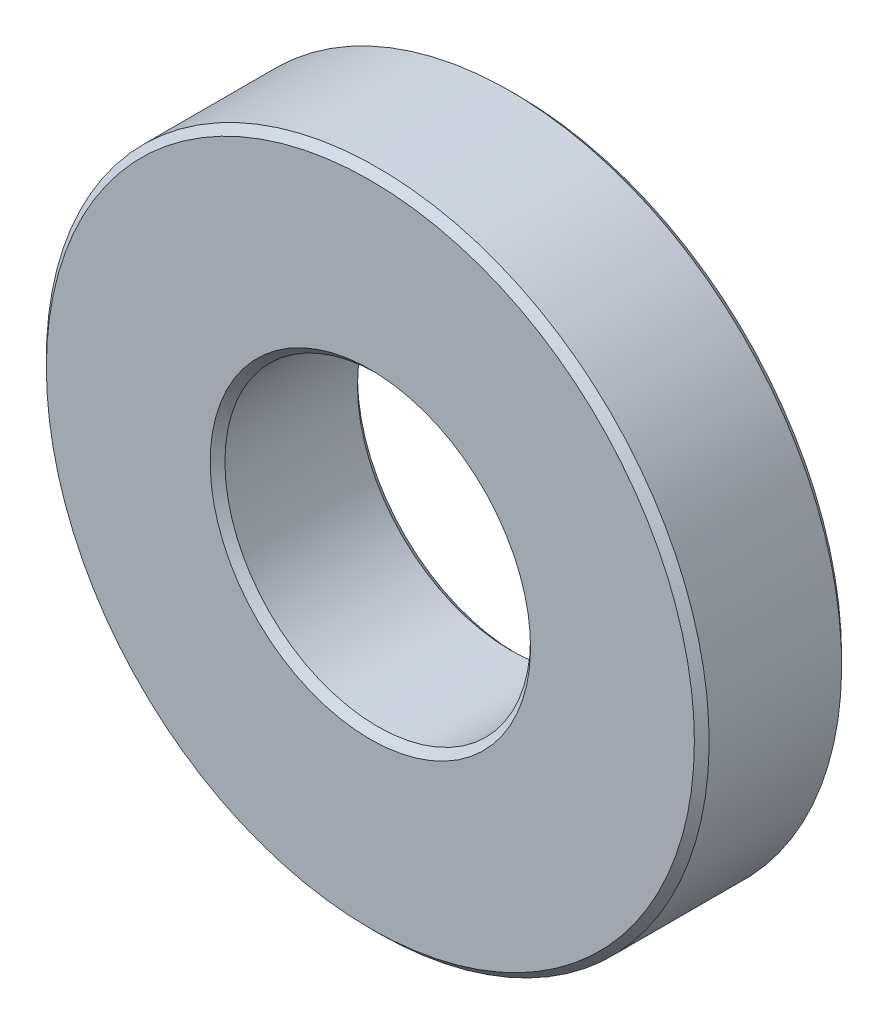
ISO-10303-21;
HEADER;
FILE_DESCRIPTION(('STEP AP214'),'2;1');
FILE_NAME('part.step','',(''),(''),'','','');
FILE_SCHEMA(('AUTOMOTIVE_DESIGN { 1 0 10303 214 1 1 1 1 }'));
ENDSEC;
DATA;
#1=APPLICATION_CONTEXT('core data for automotive mechanical design processes');
#2=APPLICATION_PROTOCOL_DEFINITION('international standard','automotive_design',2000,#1);
#3=PRODUCT_CONTEXT('',#1,'mechanical');
#4=PRODUCT('Part','Part','',(#3));
#5=PRODUCT_RELATED_PRODUCT_CATEGORY('part','',(#4));
#6=PRODUCT_DEFINITION_FORMATION('','',#4);
#7=PRODUCT_DEFINITION_CONTEXT('part definition',#1,'design');
#8=PRODUCT_DEFINITION('design','',#6,#7);
#9=PRODUCT_DEFINITION_SHAPE('','',#8);
#10=(LENGTH_UNIT() NAMED_UNIT(*) SI_UNIT(.MILLI.,.METRE.));
#11=(NAMED_UNIT(*) PLANE_ANGLE_UNIT() SI_UNIT($,.RADIAN.));
#12=(NAMED_UNIT(*) SI_UNIT($,.STERADIAN.) SOLID_ANGLE_UNIT());
#13=UNCERTAINTY_MEASURE_WITH_UNIT(LENGTH_MEASURE(1.E-05),#10,'distance_accuracy_value','');
#14=(GEOMETRIC_REPRESENTATION_CONTEXT(3) GLOBAL_UNCERTAINTY_ASSIGNED_CONTEXT((#13)) GLOBAL_UNIT_ASSIGNED_CONTEXT((#10,
#11,#12)) REPRESENTATION_CONTEXT('',''));
#15=CARTESIAN_POINT('',(0.,0.,0.));
#16=DIRECTION('',(0.,0.,1.));
#17=DIRECTION('',(1.,0.,0.));
#18=AXIS2_PLACEMENT_3D('',#15,#16,#17);
#19=CARTESIAN_POINT('',(0.,0.,0.199999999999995));
#20=DIRECTION('',(0.,0.,-1.));
#21=DIRECTION('',(0.,1.,0.));
#22=AXIS2_PLACEMENT_3D('',#19,#20,#21);
#23=CONICAL_SURFACE('',#22,4.15,0.785398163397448);
#24=CARTESIAN_POINT('',(0.,0.,0.));
#25=DIRECTION('',(0.,0.,1.));
#26=DIRECTION('',(0.,-1.,0.));
#27=AXIS2_PLACEMENT_3D('',#24,#25,#26);
#28=CIRCLE('',#27,4.35);
#29=CARTESIAN_POINT('',(0.,-4.35,0.));
#30=VERTEX_POINT('',#29);
#31=EDGE_CURVE('E10',#30,#30,#28,.T.);
#32=ORIENTED_EDGE('',*,*,#31,.F.);
#33=EDGE_LOOP('',(#32));
#34=FACE_BOUND('',#33,.T.);
#35=CARTESIAN_POINT('',(0.,0.,0.199999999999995));
#36=DIRECTION('',(0.,0.,1.));
#37=DIRECTION('',(0.,-1.,0.));
#38=AXIS2_PLACEMENT_3D('',#35,#36,#37);
#39=CIRCLE('',#38,4.15);
#40=CARTESIAN_POINT('',(0.,-4.15,0.199999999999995));
#41=VERTEX_POINT('',#40);
#42=EDGE_CURVE('E60',#41,#41,#39,.T.);
#43=ORIENTED_EDGE('',*,*,#42,.T.);
#44=EDGE_LOOP('',(#43));
#45=FACE_BOUND('',#44,.T.);
#46=ADVANCED_FACE('F32',(#34,#45),#23,.F.);
#47=CARTESIAN_POINT('',(0.,4.35,0.));
#48=DIRECTION('',(0.,0.,1.));
#49=DIRECTION('',(0.,-1.,0.));
#50=AXIS2_PLACEMENT_3D('',#47,#48,#49);
#51=PLANE('',#50);
#52=CARTESIAN_POINT('',(0.,0.,0.));
#53=DIRECTION('',(0.,0.,1.));
#54=DIRECTION('',(0.,-1.,0.));
#55=AXIS2_PLACEMENT_3D('',#52,#53,#54);
#56=CIRCLE('',#55,8.8);
#57=CARTESIAN_POINT('',(0.,-8.8,0.));
#58=VERTEX_POINT('',#57);
#59=EDGE_CURVE('E38',#58,#58,#56,.T.);
#60=ORIENTED_EDGE('',*,*,#59,.F.);
#61=EDGE_LOOP('',(#60));
#62=FACE_BOUND('',#61,.T.);
#63=ORIENTED_EDGE('',*,*,#31,.T.);
#64=EDGE_LOOP('',(#63));
#65=FACE_BOUND('',#64,.T.);
#66=ADVANCED_FACE('F97',(#62,#65),#51,.F.);
#67=CARTESIAN_POINT('',(0.,0.,0.));
#68=DIRECTION('',(0.,0.,1.));
#69=DIRECTION('',(0.,-1.,0.));
#70=AXIS2_PLACEMENT_3D('',#67,#68,#69);
#71=CONICAL_SURFACE('',#70,8.8,0.785398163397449);
#72=CARTESIAN_POINT('',(0.,0.,0.199999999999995));
#73=DIRECTION('',(0.,0.,1.));
#74=DIRECTION('',(0.,-1.,0.));
#75=AXIS2_PLACEMENT_3D('',#72,#73,#74);
#76=CIRCLE('',#75,9.);
#77=CARTESIAN_POINT('',(0.,-9.,0.199999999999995));
#78=VERTEX_POINT('',#77);
#79=EDGE_CURVE('E42',#78,#78,#76,.T.);
#80=ORIENTED_EDGE('',*,*,#79,.F.);
#81=EDGE_LOOP('',(#80));
#82=FACE_BOUND('',#81,.T.);
#83=ORIENTED_EDGE('',*,*,#59,.T.);
#84=EDGE_LOOP('',(#83));
#85=FACE_BOUND('',#84,.T.);
#86=ADVANCED_FACE('F92',(#82,#85),#71,.T.);
#87=CARTESIAN_POINT('',(0.,0.,3.99999999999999));
#88=DIRECTION('',(0.,0.,1.));
#89=DIRECTION('',(0.,-1.,0.));
#90=AXIS2_PLACEMENT_3D('',#87,#88,#89);
#91=CYLINDRICAL_SURFACE('',#90,9.);
#92=CARTESIAN_POINT('',(0.,0.,3.79999999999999));
#93=DIRECTION('',(0.,0.,1.));
#94=DIRECTION('',(0.,-1.,0.));
#95=AXIS2_PLACEMENT_3D('',#92,#93,#94);
#96=CIRCLE('',#95,9.);
#97=CARTESIAN_POINT('',(0.,-9.,3.79999999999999));
#98=VERTEX_POINT('',#97);
#99=EDGE_CURVE('E46',#98,#98,#96,.T.);
#100=ORIENTED_EDGE('',*,*,#99,.F.);
#101=EDGE_LOOP('',(#100));
#102=FACE_BOUND('',#101,.T.);
#103=ORIENTED_EDGE('',*,*,#79,.T.);
#104=EDGE_LOOP('',(#103));
#105=FACE_BOUND('',#104,.T.);
#106=ADVANCED_FACE('F86',(#102,#105),#91,.T.);
#107=CARTESIAN_POINT('',(0.,0.,3.79999999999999));
#108=DIRECTION('',(0.,0.,-1.));
#109=DIRECTION('',(0.,1.,0.));
#110=AXIS2_PLACEMENT_3D('',#107,#108,#109);
#111=CONICAL_SURFACE('',#110,9.,0.785398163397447);
#112=CARTESIAN_POINT('',(0.,0.,3.99999999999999));
#113=DIRECTION('',(0.,0.,1.));
#114=DIRECTION('',(0.,-1.,0.));
#115=AXIS2_PLACEMENT_3D('',#112,#113,#114);
#116=CIRCLE('',#115,8.8);
#117=CARTESIAN_POINT('',(0.,-8.8,3.99999999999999));
#118=VERTEX_POINT('',#117);
#119=EDGE_CURVE('E51',#118,#118,#116,.T.);
#120=ORIENTED_EDGE('',*,*,#119,.F.);
#121=EDGE_LOOP('',(#120));
#122=FACE_BOUND('',#121,.T.);
#123=ORIENTED_EDGE('',*,*,#99,.T.);
#124=EDGE_LOOP('',(#123));
#125=FACE_BOUND('',#124,.T.);
#126=ADVANCED_FACE('F80',(#122,#125),#111,.T.);
#127=CARTESIAN_POINT('',(0.,8.8,3.99999999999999));
#128=DIRECTION('',(0.,0.,-1.));
#129=DIRECTION('',(0.,1.,0.));
#130=AXIS2_PLACEMENT_3D('',#127,#128,#129);
#131=PLANE('',#130);
#132=CARTESIAN_POINT('',(0.,0.,3.99999999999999));
#133=DIRECTION('',(0.,0.,1.));
#134=DIRECTION('',(0.,-1.,0.));
#135=AXIS2_PLACEMENT_3D('',#132,#133,#134);
#136=CIRCLE('',#135,4.35000000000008);
#137=CARTESIAN_POINT('',(0.,-4.35000000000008,3.99999999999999));
#138=VERTEX_POINT('',#137);
#139=EDGE_CURVE('E54',#138,#138,#136,.T.);
#140=ORIENTED_EDGE('',*,*,#139,.F.);
#141=EDGE_LOOP('',(#140));
#142=FACE_BOUND('',#141,.T.);
#143=ORIENTED_EDGE('',*,*,#119,.T.);
#144=EDGE_LOOP('',(#143));
#145=FACE_BOUND('',#144,.T.);
#146=ADVANCED_FACE('F74',(#142,#145),#131,.F.);
#147=CARTESIAN_POINT('',(0.,0.,3.99999999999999));
#148=DIRECTION('',(0.,0.,1.));
#149=DIRECTION('',(0.,-1.,0.));
#150=AXIS2_PLACEMENT_3D('',#147,#148,#149);
#151=CONICAL_SURFACE('',#150,4.35000000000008,0.785398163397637);
#152=CARTESIAN_POINT('',(0.,0.,3.79999999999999));
#153=DIRECTION('',(0.,0.,1.));
#154=DIRECTION('',(0.,-1.,0.));
#155=AXIS2_PLACEMENT_3D('',#152,#153,#154);
#156=CIRCLE('',#155,4.15);
#157=CARTESIAN_POINT('',(0.,-4.15,3.79999999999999));
#158=VERTEX_POINT('',#157);
#159=EDGE_CURVE('E57',#158,#158,#156,.T.);
#160=ORIENTED_EDGE('',*,*,#159,.F.);
#161=EDGE_LOOP('',(#160));
#162=FACE_BOUND('',#161,.T.);
#163=ORIENTED_EDGE('',*,*,#139,.T.);
#164=EDGE_LOOP('',(#163));
#165=FACE_BOUND('',#164,.T.);
#166=ADVANCED_FACE('F68',(#162,#165),#151,.F.);
#167=CARTESIAN_POINT('',(0.,0.,3.99999999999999));
#168=DIRECTION('',(0.,0.,1.));
#169=DIRECTION('',(0.,-1.,0.));
#170=AXIS2_PLACEMENT_3D('',#167,#168,#169);
#171=CYLINDRICAL_SURFACE('',#170,4.15);
#172=ORIENTED_EDGE('',*,*,#42,.F.);
#173=EDGE_LOOP('',(#172));
#174=FACE_BOUND('',#173,.T.);
#175=ORIENTED_EDGE('',*,*,#159,.T.);
#176=EDGE_LOOP('',(#175));
#177=FACE_BOUND('',#176,.T.);
#178=ADVANCED_FACE('F65',(#174,#177),#171,.F.);
#179=CLOSED_SHELL('',(#46,#66,#86,#106,#126,#146,#166,#178));
#180=MANIFOLD_SOLID_BREP('B2',#179);
#181=ADVANCED_BREP_SHAPE_REPRESENTATION('',(#18,#180),#14);
#182=SHAPE_DEFINITION_REPRESENTATION(#9,#181);
ENDSEC;
END-ISO-10303-21;
